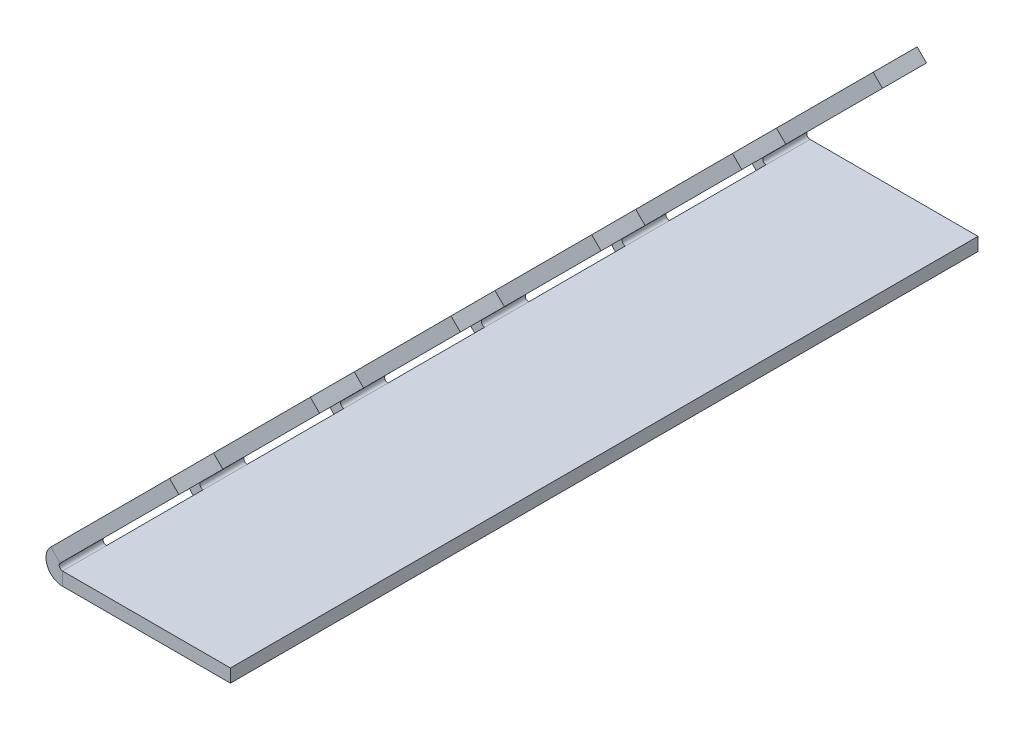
ISO-10303-21;
HEADER;
FILE_DESCRIPTION(('STEP AP214'),'2;1');
FILE_NAME('part.step','',(''),(''),'','','');
FILE_SCHEMA(('AUTOMOTIVE_DESIGN { 1 0 10303 214 1 1 1 1 }'));
ENDSEC;
DATA;
#1=APPLICATION_CONTEXT('core data for automotive mechanical design processes');
#2=APPLICATION_PROTOCOL_DEFINITION('international standard','automotive_design',2000,#1);
#3=PRODUCT_CONTEXT('',#1,'mechanical');
#4=PRODUCT('Part','Part','',(#3));
#5=PRODUCT_RELATED_PRODUCT_CATEGORY('part','',(#4));
#6=PRODUCT_DEFINITION_FORMATION('','',#4);
#7=PRODUCT_DEFINITION_CONTEXT('part definition',#1,'design');
#8=PRODUCT_DEFINITION('design','',#6,#7);
#9=PRODUCT_DEFINITION_SHAPE('','',#8);
#10=(LENGTH_UNIT() NAMED_UNIT(*) SI_UNIT(.MILLI.,.METRE.));
#11=(NAMED_UNIT(*) PLANE_ANGLE_UNIT() SI_UNIT($,.RADIAN.));
#12=(NAMED_UNIT(*) SI_UNIT($,.STERADIAN.) SOLID_ANGLE_UNIT());
#13=UNCERTAINTY_MEASURE_WITH_UNIT(LENGTH_MEASURE(1.E-05),#10,'distance_accuracy_value','');
#14=(GEOMETRIC_REPRESENTATION_CONTEXT(3) GLOBAL_UNCERTAINTY_ASSIGNED_CONTEXT((#13)) GLOBAL_UNIT_ASSIGNED_CONTEXT((#10,
#11,#12)) REPRESENTATION_CONTEXT('',''));
#15=CARTESIAN_POINT('',(0.,0.,0.));
#16=DIRECTION('',(0.,0.,1.));
#17=DIRECTION('',(1.,0.,0.));
#18=AXIS2_PLACEMENT_3D('',#15,#16,#17);
#19=CARTESIAN_POINT('',(0.,0.,170.));
#20=DIRECTION('',(-0.707106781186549,0.707106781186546,0.));
#21=DIRECTION('',(-0.707106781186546,-0.707106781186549,0.));
#22=AXIS2_PLACEMENT_3D('',#19,#20,#21);
#23=PLANE('',#22);
#24=DIRECTION('',(-0.707106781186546,-0.707106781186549,0.));
#25=VECTOR('',#24,1.);
#26=CARTESIAN_POINT('',(0.,0.,138.));
#27=LINE('',#26,#25);
#28=CARTESIAN_POINT('',(28.2842712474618,28.284271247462,138.));
#29=VERTEX_POINT('',#28);
#30=CARTESIAN_POINT('',(1.2803300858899,1.28033008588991,138.));
#31=VERTEX_POINT('',#30);
#32=EDGE_CURVE('E900',#29,#31,#27,.T.);
#33=ORIENTED_EDGE('',*,*,#32,.T.);
#34=DIRECTION('',(0.,0.,-1.));
#35=VECTOR('',#34,1.);
#36=CARTESIAN_POINT('',(1.2803300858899,1.28033008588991,170.));
#37=LINE('',#36,#35);
#38=CARTESIAN_POINT('',(1.2803300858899,1.28033008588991,128.));
#39=VERTEX_POINT('',#38);
#40=EDGE_CURVE('E627',#31,#39,#37,.T.);
#41=ORIENTED_EDGE('',*,*,#40,.T.);
#42=DIRECTION('',(0.707106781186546,0.707106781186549,0.));
#43=VECTOR('',#42,1.);
#44=CARTESIAN_POINT('',(0.,0.,128.));
#45=LINE('',#44,#43);
#46=CARTESIAN_POINT('',(28.2842712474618,28.284271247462,128.));
#47=VERTEX_POINT('',#46);
#48=EDGE_CURVE('E746',#39,#47,#45,.T.);
#49=ORIENTED_EDGE('',*,*,#48,.T.);
#50=DIRECTION('',(0.,0.,-1.));
#51=VECTOR('',#50,1.);
#52=CARTESIAN_POINT('',(28.2842712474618,28.284271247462,170.));
#53=LINE('',#52,#51);
#54=EDGE_CURVE('E1063',#29,#47,#53,.T.);
#55=ORIENTED_EDGE('',*,*,#54,.F.);
#56=EDGE_LOOP('',(#33,#41,#49,#55));
#57=FACE_BOUND('',#56,.T.);
#58=ADVANCED_FACE('F356',(#57),#23,.F.);
#59=DIRECTION('',(0.707106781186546,0.707106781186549,0.));
#60=VECTOR('',#59,1.);
#61=CARTESIAN_POINT('',(0.,0.,160.));
#62=LINE('',#61,#60);
#63=CARTESIAN_POINT('',(1.2803300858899,1.28033008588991,160.));
#64=VERTEX_POINT('',#63);
#65=CARTESIAN_POINT('',(28.2842712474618,28.284271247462,160.));
#66=VERTEX_POINT('',#65);
#67=EDGE_CURVE('E619',#64,#66,#62,.T.);
#68=ORIENTED_EDGE('',*,*,#67,.T.);
#69=CARTESIAN_POINT('',(28.2842712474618,28.284271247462,170.));
#70=VERTEX_POINT('',#69);
#71=EDGE_CURVE('E1064',#70,#66,#53,.T.);
#72=ORIENTED_EDGE('',*,*,#71,.F.);
#73=DIRECTION('',(0.707106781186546,0.707106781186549,0.));
#74=VECTOR('',#73,1.);
#75=CARTESIAN_POINT('',(0.,0.,170.));
#76=LINE('',#75,#74);
#77=CARTESIAN_POINT('',(1.2803300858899,1.28033008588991,170.));
#78=VERTEX_POINT('',#77);
#79=EDGE_CURVE('E705',#78,#70,#76,.T.);
#80=ORIENTED_EDGE('',*,*,#79,.F.);
#81=EDGE_CURVE('E645',#78,#64,#37,.T.);
#82=ORIENTED_EDGE('',*,*,#81,.T.);
#83=EDGE_LOOP('',(#68,#72,#80,#82));
#84=FACE_BOUND('',#83,.T.);
#85=ADVANCED_FACE('F1007',(#84),#23,.F.);
#86=CARTESIAN_POINT('',(26.1629509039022,30.4055915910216,170.));
#87=DIRECTION('',(0.707106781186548,0.707106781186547,0.));
#88=DIRECTION('',(-0.707106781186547,0.707106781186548,0.));
#89=AXIS2_PLACEMENT_3D('',#86,#87,#88);
#90=PLANE('',#89);
#91=DIRECTION('',(0.,0.,-1.));
#92=VECTOR('',#91,1.);
#93=CARTESIAN_POINT('',(26.1629509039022,30.4055915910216,170.));
#94=LINE('',#93,#92);
#95=CARTESIAN_POINT('',(26.1629509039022,30.4055915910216,138.));
#96=VERTEX_POINT('',#95);
#97=CARTESIAN_POINT('',(26.1629509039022,30.4055915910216,128.));
#98=VERTEX_POINT('',#97);
#99=EDGE_CURVE('E937',#96,#98,#94,.T.);
#100=ORIENTED_EDGE('',*,*,#99,.F.);
#101=DIRECTION('',(0.707106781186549,-0.707106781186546,0.));
#102=VECTOR('',#101,1.);
#103=CARTESIAN_POINT('',(28.2842712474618,28.284271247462,138.));
#104=LINE('',#103,#102);
#105=EDGE_CURVE('E893',#29,#96,#104,.F.);
#106=ORIENTED_EDGE('',*,*,#105,.F.);
#107=ORIENTED_EDGE('',*,*,#54,.T.);
#108=DIRECTION('',(0.707106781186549,-0.707106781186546,0.));
#109=VECTOR('',#108,1.);
#110=CARTESIAN_POINT('',(28.2842712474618,28.284271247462,128.));
#111=LINE('',#110,#109);
#112=EDGE_CURVE('E732',#47,#98,#111,.F.);
#113=ORIENTED_EDGE('',*,*,#112,.T.);
#114=EDGE_LOOP('',(#100,#106,#107,#113));
#115=FACE_BOUND('',#114,.T.);
#116=ADVANCED_FACE('F1014',(#115),#90,.T.);
#117=ORIENTED_EDGE('',*,*,#71,.T.);
#118=DIRECTION('',(0.707106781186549,-0.707106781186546,0.));
#119=VECTOR('',#118,1.);
#120=CARTESIAN_POINT('',(28.2842712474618,28.284271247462,160.));
#121=LINE('',#120,#119);
#122=CARTESIAN_POINT('',(26.1629509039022,30.4055915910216,160.));
#123=VERTEX_POINT('',#122);
#124=EDGE_CURVE('E890',#66,#123,#121,.F.);
#125=ORIENTED_EDGE('',*,*,#124,.T.);
#126=CARTESIAN_POINT('',(26.1629509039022,30.4055915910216,170.));
#127=VERTEX_POINT('',#126);
#128=EDGE_CURVE('E925',#127,#123,#94,.T.);
#129=ORIENTED_EDGE('',*,*,#128,.F.);
#130=DIRECTION('',(0.707106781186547,-0.707106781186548,0.));
#131=VECTOR('',#130,1.);
#132=CARTESIAN_POINT('',(26.1629509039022,30.4055915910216,170.));
#133=LINE('',#132,#131);
#134=EDGE_CURVE('E702',#127,#70,#133,.T.);
#135=ORIENTED_EDGE('',*,*,#134,.T.);
#136=EDGE_LOOP('',(#117,#125,#129,#135));
#137=FACE_BOUND('',#136,.T.);
#138=ADVANCED_FACE('F1155',(#137),#90,.T.);
#139=CARTESIAN_POINT('',(-2.12132034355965,2.12132034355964,170.));
#140=DIRECTION('',(-0.707106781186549,0.707106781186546,0.));
#141=DIRECTION('',(-0.707106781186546,-0.707106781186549,0.));
#142=AXIS2_PLACEMENT_3D('',#139,#140,#141);
#143=PLANE('',#142);
#144=DIRECTION('',(0.,0.,-1.));
#145=VECTOR('',#144,1.);
#146=CARTESIAN_POINT('',(-0.840990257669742,3.40165042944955,170.));
#147=LINE('',#146,#145);
#148=CARTESIAN_POINT('',(-0.840990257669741,3.40165042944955,138.));
#149=VERTEX_POINT('',#148);
#150=CARTESIAN_POINT('',(-0.840990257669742,3.40165042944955,128.));
#151=VERTEX_POINT('',#150);
#152=EDGE_CURVE('E932',#149,#151,#147,.T.);
#153=ORIENTED_EDGE('',*,*,#152,.F.);
#154=DIRECTION('',(-0.707106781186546,-0.707106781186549,0.));
#155=VECTOR('',#154,1.);
#156=CARTESIAN_POINT('',(-2.12132034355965,2.12132034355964,138.));
#157=LINE('',#156,#155);
#158=EDGE_CURVE('E891',#96,#149,#157,.T.);
#159=ORIENTED_EDGE('',*,*,#158,.F.);
#160=ORIENTED_EDGE('',*,*,#99,.T.);
#161=DIRECTION('',(-0.707106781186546,-0.707106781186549,0.));
#162=VECTOR('',#161,1.);
#163=CARTESIAN_POINT('',(-2.12132034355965,2.12132034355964,128.));
#164=LINE('',#163,#162);
#165=EDGE_CURVE('E741',#151,#98,#164,.F.);
#166=ORIENTED_EDGE('',*,*,#165,.F.);
#167=EDGE_LOOP('',(#153,#159,#160,#166));
#168=FACE_BOUND('',#167,.T.);
#169=ADVANCED_FACE('F1114',(#168),#143,.T.);
#170=ORIENTED_EDGE('',*,*,#128,.T.);
#171=DIRECTION('',(-0.707106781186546,-0.707106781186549,0.));
#172=VECTOR('',#171,1.);
#173=CARTESIAN_POINT('',(-2.12132034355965,2.12132034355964,160.));
#174=LINE('',#173,#172);
#175=CARTESIAN_POINT('',(-0.840990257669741,3.40165042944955,160.));
#176=VERTEX_POINT('',#175);
#177=EDGE_CURVE('E898',#176,#123,#174,.F.);
#178=ORIENTED_EDGE('',*,*,#177,.F.);
#179=CARTESIAN_POINT('',(-0.840990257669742,3.40165042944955,170.));
#180=VERTEX_POINT('',#179);
#181=EDGE_CURVE('E923',#180,#176,#147,.T.);
#182=ORIENTED_EDGE('',*,*,#181,.F.);
#183=DIRECTION('',(0.707106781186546,0.707106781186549,0.));
#184=VECTOR('',#183,1.);
#185=CARTESIAN_POINT('',(-2.12132034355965,2.12132034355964,170.));
#186=LINE('',#185,#184);
#187=EDGE_CURVE('E699',#180,#127,#186,.T.);
#188=ORIENTED_EDGE('',*,*,#187,.T.);
#189=EDGE_LOOP('',(#170,#178,#182,#188));
#190=FACE_BOUND('',#189,.T.);
#191=ADVANCED_FACE('F922',(#190),#143,.T.);
#192=CARTESIAN_POINT('',(1.81066017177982,0.75,170.));
#193=DIRECTION('',(0.,0.,-1.));
#194=DIRECTION('',(-1.,0.,0.));
#195=AXIS2_PLACEMENT_3D('',#192,#193,#194);
#196=CYLINDRICAL_SURFACE('',#195,3.75);
#197=DIRECTION('',(0.,0.,-1.));
#198=VECTOR('',#197,1.);
#199=CARTESIAN_POINT('',(1.81066017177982,-3.,170.));
#200=LINE('',#199,#198);
#201=CARTESIAN_POINT('',(1.81066017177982,-3.,138.));
#202=VERTEX_POINT('',#201);
#203=CARTESIAN_POINT('',(1.81066017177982,-3.,128.));
#204=VERTEX_POINT('',#203);
#205=EDGE_CURVE('E963',#202,#204,#200,.T.);
#206=ORIENTED_EDGE('',*,*,#205,.F.);
#207=CARTESIAN_POINT('',(1.81066017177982,0.75,138.));
#208=DIRECTION('',(0.,0.,-1.));
#209=DIRECTION('',(-1.,0.,0.));
#210=AXIS2_PLACEMENT_3D('',#207,#208,#209);
#211=CIRCLE('',#210,3.75);
#212=EDGE_CURVE('E618',#149,#202,#211,.F.);
#213=ORIENTED_EDGE('',*,*,#212,.F.);
#214=ORIENTED_EDGE('',*,*,#152,.T.);
#215=CARTESIAN_POINT('',(1.81066017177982,0.75,128.));
#216=DIRECTION('',(0.,0.,1.));
#217=DIRECTION('',(1.,0.,0.));
#218=AXIS2_PLACEMENT_3D('',#215,#216,#217);
#219=CIRCLE('',#218,3.75);
#220=EDGE_CURVE('E756',#204,#151,#219,.F.);
#221=ORIENTED_EDGE('',*,*,#220,.F.);
#222=EDGE_LOOP('',(#206,#213,#214,#221));
#223=FACE_BOUND('',#222,.T.);
#224=ADVANCED_FACE('F1111',(#223),#196,.T.);
#225=ORIENTED_EDGE('',*,*,#181,.T.);
#226=CARTESIAN_POINT('',(1.81066017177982,0.75,160.));
#227=DIRECTION('',(0.,0.,-1.));
#228=DIRECTION('',(-1.,0.,0.));
#229=AXIS2_PLACEMENT_3D('',#226,#227,#228);
#230=CIRCLE('',#229,3.75);
#231=CARTESIAN_POINT('',(1.81066017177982,-3.,160.));
#232=VERTEX_POINT('',#231);
#233=EDGE_CURVE('E628',#232,#176,#230,.T.);
#234=ORIENTED_EDGE('',*,*,#233,.F.);
#235=CARTESIAN_POINT('',(1.81066017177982,-3.,170.));
#236=VERTEX_POINT('',#235);
#237=EDGE_CURVE('E957',#236,#232,#200,.T.);
#238=ORIENTED_EDGE('',*,*,#237,.F.);
#239=CARTESIAN_POINT('',(1.81066017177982,0.75,170.));
#240=DIRECTION('',(0.,0.,1.));
#241=DIRECTION('',(1.,0.,0.));
#242=AXIS2_PLACEMENT_3D('',#239,#240,#241);
#243=CIRCLE('',#242,3.75);
#244=EDGE_CURVE('E696',#236,#180,#243,.F.);
#245=ORIENTED_EDGE('',*,*,#244,.T.);
#246=EDGE_LOOP('',(#225,#234,#238,#245));
#247=FACE_BOUND('',#246,.T.);
#248=ADVANCED_FACE('F927',(#247),#196,.T.);
#249=CARTESIAN_POINT('',(1.81066017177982,0.75,170.));
#250=DIRECTION('',(0.,0.,-1.));
#251=DIRECTION('',(-1.,0.,0.));
#252=AXIS2_PLACEMENT_3D('',#249,#250,#251);
#253=CYLINDRICAL_SURFACE('',#252,0.75);
#254=CARTESIAN_POINT('',(1.81066017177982,0.75,138.));
#255=DIRECTION('',(0.,0.,-1.));
#256=DIRECTION('',(-1.,0.,0.));
#257=AXIS2_PLACEMENT_3D('',#254,#255,#256);
#258=CIRCLE('',#257,0.75);
#259=CARTESIAN_POINT('',(1.81066017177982,0.,138.));
#260=VERTEX_POINT('',#259);
#261=EDGE_CURVE('E608',#31,#260,#258,.F.);
#262=ORIENTED_EDGE('',*,*,#261,.T.);
#263=DIRECTION('',(0.,0.,-1.));
#264=VECTOR('',#263,1.);
#265=CARTESIAN_POINT('',(1.81066017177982,0.,170.));
#266=LINE('',#265,#264);
#267=CARTESIAN_POINT('',(1.81066017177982,0.,128.));
#268=VERTEX_POINT('',#267);
#269=EDGE_CURVE('E625',#260,#268,#266,.T.);
#270=ORIENTED_EDGE('',*,*,#269,.T.);
#271=CARTESIAN_POINT('',(1.81066017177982,0.75,128.));
#272=DIRECTION('',(0.,0.,-1.));
#273=DIRECTION('',(-1.,0.,0.));
#274=AXIS2_PLACEMENT_3D('',#271,#272,#273);
#275=CIRCLE('',#274,0.75);
#276=EDGE_CURVE('E750',#268,#39,#275,.T.);
#277=ORIENTED_EDGE('',*,*,#276,.T.);
#278=ORIENTED_EDGE('',*,*,#40,.F.);
#279=EDGE_LOOP('',(#262,#270,#277,#278));
#280=FACE_BOUND('',#279,.T.);
#281=ADVANCED_FACE('F623',(#280),#253,.F.);
#282=CARTESIAN_POINT('',(1.81066017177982,0.75,160.));
#283=DIRECTION('',(0.,0.,1.));
#284=DIRECTION('',(1.,0.,0.));
#285=AXIS2_PLACEMENT_3D('',#282,#283,#284);
#286=CIRCLE('',#285,0.75);
#287=CARTESIAN_POINT('',(1.81066017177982,0.,160.));
#288=VERTEX_POINT('',#287);
#289=EDGE_CURVE('E609',#288,#64,#286,.F.);
#290=ORIENTED_EDGE('',*,*,#289,.T.);
#291=ORIENTED_EDGE('',*,*,#81,.F.);
#292=CARTESIAN_POINT('',(1.81066017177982,0.75,170.));
#293=DIRECTION('',(0.,0.,1.));
#294=DIRECTION('',(1.,0.,0.));
#295=AXIS2_PLACEMENT_3D('',#292,#293,#294);
#296=CIRCLE('',#295,0.75);
#297=CARTESIAN_POINT('',(1.81066017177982,0.,170.));
#298=VERTEX_POINT('',#297);
#299=EDGE_CURVE('E677',#298,#78,#296,.F.);
#300=ORIENTED_EDGE('',*,*,#299,.F.);
#301=EDGE_CURVE('E635',#298,#288,#266,.T.);
#302=ORIENTED_EDGE('',*,*,#301,.T.);
#303=EDGE_LOOP('',(#290,#291,#300,#302));
#304=FACE_BOUND('',#303,.T.);
#305=ADVANCED_FACE('F910',(#304),#253,.F.);
#306=DIRECTION('',(-0.707106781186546,-0.707106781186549,0.));
#307=VECTOR('',#306,1.);
#308=CARTESIAN_POINT('',(0.,0.,10.));
#309=LINE('',#308,#307);
#310=CARTESIAN_POINT('',(28.2842712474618,28.284271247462,10.));
#311=VERTEX_POINT('',#310);
#312=CARTESIAN_POINT('',(1.2803300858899,1.28033008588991,10.));
#313=VERTEX_POINT('',#312);
#314=EDGE_CURVE('E864',#311,#313,#309,.T.);
#315=ORIENTED_EDGE('',*,*,#314,.T.);
#316=CARTESIAN_POINT('',(1.2803300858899,1.28033008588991,0.));
#317=VERTEX_POINT('',#316);
#318=EDGE_CURVE('E658',#313,#317,#37,.T.);
#319=ORIENTED_EDGE('',*,*,#318,.T.);
#320=DIRECTION('',(0.707106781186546,0.707106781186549,0.));
#321=VECTOR('',#320,1.);
#322=CARTESIAN_POINT('',(0.,0.,0.));
#323=LINE('',#322,#321);
#324=CARTESIAN_POINT('',(28.2842712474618,28.284271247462,0.));
#325=VERTEX_POINT('',#324);
#326=EDGE_CURVE('E726',#317,#325,#323,.T.);
#327=ORIENTED_EDGE('',*,*,#326,.T.);
#328=EDGE_CURVE('E1066',#311,#325,#53,.T.);
#329=ORIENTED_EDGE('',*,*,#328,.F.);
#330=EDGE_LOOP('',(#315,#319,#327,#329));
#331=FACE_BOUND('',#330,.T.);
#332=ADVANCED_FACE('F1010',(#331),#23,.F.);
#333=DIRECTION('',(0.707106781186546,0.707106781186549,0.));
#334=VECTOR('',#333,1.);
#335=CARTESIAN_POINT('',(0.,0.,32.));
#336=LINE('',#335,#334);
#337=CARTESIAN_POINT('',(1.2803300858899,1.28033008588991,32.));
#338=VERTEX_POINT('',#337);
#339=CARTESIAN_POINT('',(28.2842712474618,28.284271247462,32.));
#340=VERTEX_POINT('',#339);
#341=EDGE_CURVE('E866',#338,#340,#336,.T.);
#342=ORIENTED_EDGE('',*,*,#341,.T.);
#343=CARTESIAN_POINT('',(28.2842712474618,28.284271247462,42.));
#344=VERTEX_POINT('',#343);
#345=EDGE_CURVE('E1060',#344,#340,#53,.T.);
#346=ORIENTED_EDGE('',*,*,#345,.F.);
#347=DIRECTION('',(-0.707106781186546,-0.707106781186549,0.));
#348=VECTOR('',#347,1.);
#349=CARTESIAN_POINT('',(0.,0.,42.));
#350=LINE('',#349,#348);
#351=CARTESIAN_POINT('',(1.2803300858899,1.28033008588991,42.));
#352=VERTEX_POINT('',#351);
#353=EDGE_CURVE('E824',#344,#352,#350,.T.);
#354=ORIENTED_EDGE('',*,*,#353,.T.);
#355=EDGE_CURVE('E667',#352,#338,#37,.T.);
#356=ORIENTED_EDGE('',*,*,#355,.T.);
#357=EDGE_LOOP('',(#342,#346,#354,#356));
#358=FACE_BOUND('',#357,.T.);
#359=ADVANCED_FACE('F1015',(#358),#23,.F.);
#360=CARTESIAN_POINT('',(26.1629509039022,30.4055915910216,10.));
#361=VERTEX_POINT('',#360);
#362=CARTESIAN_POINT('',(26.1629509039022,30.4055915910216,0.));
#363=VERTEX_POINT('',#362);
#364=EDGE_CURVE('E931',#361,#363,#94,.T.);
#365=ORIENTED_EDGE('',*,*,#364,.F.);
#366=DIRECTION('',(0.707106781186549,-0.707106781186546,0.));
#367=VECTOR('',#366,1.);
#368=CARTESIAN_POINT('',(28.2842712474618,28.284271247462,10.));
#369=LINE('',#368,#367);
#370=EDGE_CURVE('E857',#311,#361,#369,.F.);
#371=ORIENTED_EDGE('',*,*,#370,.F.);
#372=ORIENTED_EDGE('',*,*,#328,.T.);
#373=DIRECTION('',(0.707106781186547,-0.707106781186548,0.));
#374=VECTOR('',#373,1.);
#375=CARTESIAN_POINT('',(26.1629509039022,30.4055915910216,0.));
#376=LINE('',#375,#374);
#377=EDGE_CURVE('E723',#363,#325,#376,.T.);
#378=ORIENTED_EDGE('',*,*,#377,.F.);
#379=EDGE_LOOP('',(#365,#371,#372,#378));
#380=FACE_BOUND('',#379,.T.);
#381=ADVANCED_FACE('F1024',(#380),#90,.T.);
#382=ORIENTED_EDGE('',*,*,#345,.T.);
#383=DIRECTION('',(0.707106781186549,-0.707106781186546,0.));
#384=VECTOR('',#383,1.);
#385=CARTESIAN_POINT('',(28.2842712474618,28.284271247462,32.));
#386=LINE('',#385,#384);
#387=CARTESIAN_POINT('',(26.1629509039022,30.4055915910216,32.));
#388=VERTEX_POINT('',#387);
#389=EDGE_CURVE('E853',#340,#388,#386,.F.);
#390=ORIENTED_EDGE('',*,*,#389,.T.);
#391=CARTESIAN_POINT('',(26.1629509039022,30.4055915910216,42.));
#392=VERTEX_POINT('',#391);
#393=EDGE_CURVE('E935',#392,#388,#94,.T.);
#394=ORIENTED_EDGE('',*,*,#393,.F.);
#395=DIRECTION('',(0.707106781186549,-0.707106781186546,0.));
#396=VECTOR('',#395,1.);
#397=CARTESIAN_POINT('',(28.2842712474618,28.284271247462,42.));
#398=LINE('',#397,#396);
#399=EDGE_CURVE('E817',#344,#392,#398,.F.);
#400=ORIENTED_EDGE('',*,*,#399,.F.);
#401=EDGE_LOOP('',(#382,#390,#394,#400));
#402=FACE_BOUND('',#401,.T.);
#403=ADVANCED_FACE('F1048',(#402),#90,.T.);
#404=CARTESIAN_POINT('',(-0.840990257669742,3.40165042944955,10.));
#405=VERTEX_POINT('',#404);
#406=CARTESIAN_POINT('',(-0.840990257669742,3.40165042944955,0.));
#407=VERTEX_POINT('',#406);
#408=EDGE_CURVE('E938',#405,#407,#147,.T.);
#409=ORIENTED_EDGE('',*,*,#408,.F.);
#410=DIRECTION('',(-0.707106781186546,-0.707106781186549,0.));
#411=VECTOR('',#410,1.);
#412=CARTESIAN_POINT('',(-2.12132034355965,2.12132034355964,10.));
#413=LINE('',#412,#411);
#414=EDGE_CURVE('E854',#361,#405,#413,.T.);
#415=ORIENTED_EDGE('',*,*,#414,.F.);
#416=ORIENTED_EDGE('',*,*,#364,.T.);
#417=DIRECTION('',(0.707106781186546,0.707106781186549,0.));
#418=VECTOR('',#417,1.);
#419=CARTESIAN_POINT('',(-2.12132034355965,2.12132034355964,0.));
#420=LINE('',#419,#418);
#421=EDGE_CURVE('E720',#407,#363,#420,.T.);
#422=ORIENTED_EDGE('',*,*,#421,.F.);
#423=EDGE_LOOP('',(#409,#415,#416,#422));
#424=FACE_BOUND('',#423,.T.);
#425=ADVANCED_FACE('F1149',(#424),#143,.T.);
#426=ORIENTED_EDGE('',*,*,#393,.T.);
#427=DIRECTION('',(-0.707106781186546,-0.707106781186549,0.));
#428=VECTOR('',#427,1.);
#429=CARTESIAN_POINT('',(-2.12132034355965,2.12132034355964,32.));
#430=LINE('',#429,#428);
#431=CARTESIAN_POINT('',(-0.840990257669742,3.40165042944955,32.));
#432=VERTEX_POINT('',#431);
#433=EDGE_CURVE('E862',#432,#388,#430,.F.);
#434=ORIENTED_EDGE('',*,*,#433,.F.);
#435=CARTESIAN_POINT('',(-0.840990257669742,3.40165042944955,42.));
#436=VERTEX_POINT('',#435);
#437=EDGE_CURVE('E947',#436,#432,#147,.T.);
#438=ORIENTED_EDGE('',*,*,#437,.F.);
#439=DIRECTION('',(-0.707106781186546,-0.707106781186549,0.));
#440=VECTOR('',#439,1.);
#441=CARTESIAN_POINT('',(-2.12132034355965,2.12132034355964,42.));
#442=LINE('',#441,#440);
#443=EDGE_CURVE('E814',#392,#436,#442,.T.);
#444=ORIENTED_EDGE('',*,*,#443,.F.);
#445=EDGE_LOOP('',(#426,#434,#438,#444));
#446=FACE_BOUND('',#445,.T.);
#447=ADVANCED_FACE('F1129',(#446),#143,.T.);
#448=CARTESIAN_POINT('',(1.81066017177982,-3.,10.));
#449=VERTEX_POINT('',#448);
#450=CARTESIAN_POINT('',(1.81066017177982,-3.,0.));
#451=VERTEX_POINT('',#450);
#452=EDGE_CURVE('E967',#449,#451,#200,.T.);
#453=ORIENTED_EDGE('',*,*,#452,.F.);
#454=CARTESIAN_POINT('',(1.81066017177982,0.75,10.));
#455=DIRECTION('',(0.,0.,-1.));
#456=DIRECTION('',(-1.,0.,0.));
#457=AXIS2_PLACEMENT_3D('',#454,#455,#456);
#458=CIRCLE('',#457,3.75);
#459=EDGE_CURVE('E872',#405,#449,#458,.F.);
#460=ORIENTED_EDGE('',*,*,#459,.F.);
#461=ORIENTED_EDGE('',*,*,#408,.T.);
#462=CARTESIAN_POINT('',(1.81066017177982,0.75,0.));
#463=DIRECTION('',(0.,0.,1.));
#464=DIRECTION('',(1.,0.,0.));
#465=AXIS2_PLACEMENT_3D('',#462,#463,#464);
#466=CIRCLE('',#465,3.75);
#467=EDGE_CURVE('E717',#451,#407,#466,.F.);
#468=ORIENTED_EDGE('',*,*,#467,.F.);
#469=EDGE_LOOP('',(#453,#460,#461,#468));
#470=FACE_BOUND('',#469,.T.);
#471=ADVANCED_FACE('F1146',(#470),#196,.T.);
#472=ORIENTED_EDGE('',*,*,#437,.T.);
#473=CARTESIAN_POINT('',(1.81066017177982,0.75,32.));
#474=DIRECTION('',(0.,0.,1.));
#475=DIRECTION('',(1.,0.,0.));
#476=AXIS2_PLACEMENT_3D('',#473,#474,#475);
#477=CIRCLE('',#476,3.75);
#478=CARTESIAN_POINT('',(1.81066017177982,-3.,32.));
#479=VERTEX_POINT('',#478);
#480=EDGE_CURVE('E875',#479,#432,#477,.F.);
#481=ORIENTED_EDGE('',*,*,#480,.F.);
#482=CARTESIAN_POINT('',(1.81066017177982,-3.,42.));
#483=VERTEX_POINT('',#482);
#484=EDGE_CURVE('E975',#483,#479,#200,.T.);
#485=ORIENTED_EDGE('',*,*,#484,.F.);
#486=CARTESIAN_POINT('',(1.81066017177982,0.75,42.));
#487=DIRECTION('',(0.,0.,-1.));
#488=DIRECTION('',(-1.,0.,0.));
#489=AXIS2_PLACEMENT_3D('',#486,#487,#488);
#490=CIRCLE('',#489,3.75);
#491=EDGE_CURVE('E832',#436,#483,#490,.F.);
#492=ORIENTED_EDGE('',*,*,#491,.F.);
#493=EDGE_LOOP('',(#472,#481,#485,#492));
#494=FACE_BOUND('',#493,.T.);
#495=ADVANCED_FACE('F1182',(#494),#196,.T.);
#496=CARTESIAN_POINT('',(1.81066017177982,0.75,10.));
#497=DIRECTION('',(0.,0.,-1.));
#498=DIRECTION('',(-1.,0.,0.));
#499=AXIS2_PLACEMENT_3D('',#496,#497,#498);
#500=CIRCLE('',#499,0.75);
#501=CARTESIAN_POINT('',(1.81066017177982,0.,10.));
#502=VERTEX_POINT('',#501);
#503=EDGE_CURVE('E868',#313,#502,#500,.F.);
#504=ORIENTED_EDGE('',*,*,#503,.T.);
#505=CARTESIAN_POINT('',(1.81066017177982,0.,0.));
#506=VERTEX_POINT('',#505);
#507=EDGE_CURVE('E638',#502,#506,#266,.T.);
#508=ORIENTED_EDGE('',*,*,#507,.T.);
#509=CARTESIAN_POINT('',(1.81066017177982,0.75,0.));
#510=DIRECTION('',(0.,0.,1.));
#511=DIRECTION('',(1.,0.,0.));
#512=AXIS2_PLACEMENT_3D('',#509,#510,#511);
#513=CIRCLE('',#512,0.75);
#514=EDGE_CURVE('E707',#506,#317,#513,.F.);
#515=ORIENTED_EDGE('',*,*,#514,.T.);
#516=ORIENTED_EDGE('',*,*,#318,.F.);
#517=EDGE_LOOP('',(#504,#508,#515,#516));
#518=FACE_BOUND('',#517,.T.);
#519=ADVANCED_FACE('F1049',(#518),#253,.F.);
#520=CARTESIAN_POINT('',(1.81066017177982,0.75,32.));
#521=DIRECTION('',(0.,0.,-1.));
#522=DIRECTION('',(-1.,0.,0.));
#523=AXIS2_PLACEMENT_3D('',#520,#521,#522);
#524=CIRCLE('',#523,0.75);
#525=CARTESIAN_POINT('',(1.81066017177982,0.,32.));
#526=VERTEX_POINT('',#525);
#527=EDGE_CURVE('E869',#526,#338,#524,.T.);
#528=ORIENTED_EDGE('',*,*,#527,.T.);
#529=ORIENTED_EDGE('',*,*,#355,.F.);
#530=CARTESIAN_POINT('',(1.81066017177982,0.75,42.));
#531=DIRECTION('',(0.,0.,-1.));
#532=DIRECTION('',(-1.,0.,0.));
#533=AXIS2_PLACEMENT_3D('',#530,#531,#532);
#534=CIRCLE('',#533,0.75);
#535=CARTESIAN_POINT('',(1.81066017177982,0.,42.));
#536=VERTEX_POINT('',#535);
#537=EDGE_CURVE('E828',#352,#536,#534,.F.);
#538=ORIENTED_EDGE('',*,*,#537,.T.);
#539=EDGE_CURVE('E644',#536,#526,#266,.T.);
#540=ORIENTED_EDGE('',*,*,#539,.T.);
#541=EDGE_LOOP('',(#528,#529,#538,#540));
#542=FACE_BOUND('',#541,.T.);
#543=ADVANCED_FACE('F1027',(#542),#253,.F.);
#544=DIRECTION('',(0.707106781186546,0.707106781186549,0.));
#545=VECTOR('',#544,1.);
#546=CARTESIAN_POINT('',(0.,0.,64.));
#547=LINE('',#546,#545);
#548=CARTESIAN_POINT('',(1.2803300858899,1.28033008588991,64.));
#549=VERTEX_POINT('',#548);
#550=CARTESIAN_POINT('',(28.2842712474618,28.284271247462,64.));
#551=VERTEX_POINT('',#550);
#552=EDGE_CURVE('E826',#549,#551,#547,.T.);
#553=ORIENTED_EDGE('',*,*,#552,.T.);
#554=CARTESIAN_POINT('',(28.2842712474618,28.284271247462,74.));
#555=VERTEX_POINT('',#554);
#556=EDGE_CURVE('E1053',#555,#551,#53,.T.);
#557=ORIENTED_EDGE('',*,*,#556,.F.);
#558=DIRECTION('',(-0.707106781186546,-0.707106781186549,0.));
#559=VECTOR('',#558,1.);
#560=CARTESIAN_POINT('',(0.,0.,74.));
#561=LINE('',#560,#559);
#562=CARTESIAN_POINT('',(1.2803300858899,1.28033008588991,74.));
#563=VERTEX_POINT('',#562);
#564=EDGE_CURVE('E784',#555,#563,#561,.T.);
#565=ORIENTED_EDGE('',*,*,#564,.T.);
#566=EDGE_CURVE('E661',#563,#549,#37,.T.);
#567=ORIENTED_EDGE('',*,*,#566,.T.);
#568=EDGE_LOOP('',(#553,#557,#565,#567));
#569=FACE_BOUND('',#568,.T.);
#570=ADVANCED_FACE('F1025',(#569),#23,.F.);
#571=ORIENTED_EDGE('',*,*,#556,.T.);
#572=DIRECTION('',(0.707106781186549,-0.707106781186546,0.));
#573=VECTOR('',#572,1.);
#574=CARTESIAN_POINT('',(28.2842712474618,28.284271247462,64.));
#575=LINE('',#574,#573);
#576=CARTESIAN_POINT('',(26.1629509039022,30.4055915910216,64.));
#577=VERTEX_POINT('',#576);
#578=EDGE_CURVE('E813',#551,#577,#575,.F.);
#579=ORIENTED_EDGE('',*,*,#578,.T.);
#580=CARTESIAN_POINT('',(26.1629509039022,30.4055915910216,74.));
#581=VERTEX_POINT('',#580);
#582=EDGE_CURVE('E1116',#581,#577,#94,.T.);
#583=ORIENTED_EDGE('',*,*,#582,.F.);
#584=DIRECTION('',(0.707106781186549,-0.707106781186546,0.));
#585=VECTOR('',#584,1.);
#586=CARTESIAN_POINT('',(28.2842712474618,28.284271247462,74.));
#587=LINE('',#586,#585);
#588=EDGE_CURVE('E777',#555,#581,#587,.F.);
#589=ORIENTED_EDGE('',*,*,#588,.F.);
#590=EDGE_LOOP('',(#571,#579,#583,#589));
#591=FACE_BOUND('',#590,.T.);
#592=ADVANCED_FACE('F1037',(#591),#90,.T.);
#593=ORIENTED_EDGE('',*,*,#582,.T.);
#594=DIRECTION('',(-0.707106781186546,-0.707106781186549,0.));
#595=VECTOR('',#594,1.);
#596=CARTESIAN_POINT('',(-2.12132034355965,2.12132034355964,64.));
#597=LINE('',#596,#595);
#598=CARTESIAN_POINT('',(-0.840990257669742,3.40165042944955,64.));
#599=VERTEX_POINT('',#598);
#600=EDGE_CURVE('E822',#599,#577,#597,.F.);
#601=ORIENTED_EDGE('',*,*,#600,.F.);
#602=CARTESIAN_POINT('',(-0.840990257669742,3.40165042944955,74.));
#603=VERTEX_POINT('',#602);
#604=EDGE_CURVE('E941',#603,#599,#147,.T.);
#605=ORIENTED_EDGE('',*,*,#604,.F.);
#606=DIRECTION('',(-0.707106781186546,-0.707106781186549,0.));
#607=VECTOR('',#606,1.);
#608=CARTESIAN_POINT('',(-2.12132034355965,2.12132034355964,74.));
#609=LINE('',#608,#607);
#610=EDGE_CURVE('E774',#581,#603,#609,.T.);
#611=ORIENTED_EDGE('',*,*,#610,.F.);
#612=EDGE_LOOP('',(#593,#601,#605,#611));
#613=FACE_BOUND('',#612,.T.);
#614=ADVANCED_FACE('F1046',(#613),#143,.T.);
#615=ORIENTED_EDGE('',*,*,#604,.T.);
#616=CARTESIAN_POINT('',(1.81066017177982,0.75,64.));
#617=DIRECTION('',(0.,0.,1.));
#618=DIRECTION('',(1.,0.,0.));
#619=AXIS2_PLACEMENT_3D('',#616,#617,#618);
#620=CIRCLE('',#619,3.75);
#621=CARTESIAN_POINT('',(1.81066017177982,-3.,64.));
#622=VERTEX_POINT('',#621);
#623=EDGE_CURVE('E836',#622,#599,#620,.F.);
#624=ORIENTED_EDGE('',*,*,#623,.F.);
#625=CARTESIAN_POINT('',(1.81066017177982,-3.,74.));
#626=VERTEX_POINT('',#625);
#627=EDGE_CURVE('E970',#626,#622,#200,.T.);
#628=ORIENTED_EDGE('',*,*,#627,.F.);
#629=CARTESIAN_POINT('',(1.81066017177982,0.75,74.));
#630=DIRECTION('',(0.,0.,-1.));
#631=DIRECTION('',(-1.,0.,0.));
#632=AXIS2_PLACEMENT_3D('',#629,#630,#631);
#633=CIRCLE('',#632,3.75);
#634=EDGE_CURVE('E792',#603,#626,#633,.F.);
#635=ORIENTED_EDGE('',*,*,#634,.F.);
#636=EDGE_LOOP('',(#615,#624,#628,#635));
#637=FACE_BOUND('',#636,.T.);
#638=ADVANCED_FACE('F1038',(#637),#196,.T.);
#639=CARTESIAN_POINT('',(1.81066017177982,0.75,64.));
#640=DIRECTION('',(0.,0.,-1.));
#641=DIRECTION('',(-1.,0.,0.));
#642=AXIS2_PLACEMENT_3D('',#639,#640,#641);
#643=CIRCLE('',#642,0.75);
#644=CARTESIAN_POINT('',(1.81066017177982,0.,64.));
#645=VERTEX_POINT('',#644);
#646=EDGE_CURVE('E829',#645,#549,#643,.T.);
#647=ORIENTED_EDGE('',*,*,#646,.T.);
#648=ORIENTED_EDGE('',*,*,#566,.F.);
#649=CARTESIAN_POINT('',(1.81066017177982,0.75,74.));
#650=DIRECTION('',(0.,0.,-1.));
#651=DIRECTION('',(-1.,0.,0.));
#652=AXIS2_PLACEMENT_3D('',#649,#650,#651);
#653=CIRCLE('',#652,0.75);
#654=CARTESIAN_POINT('',(1.81066017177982,0.,74.));
#655=VERTEX_POINT('',#654);
#656=EDGE_CURVE('E788',#563,#655,#653,.F.);
#657=ORIENTED_EDGE('',*,*,#656,.T.);
#658=EDGE_CURVE('E641',#655,#645,#266,.T.);
#659=ORIENTED_EDGE('',*,*,#658,.T.);
#660=EDGE_LOOP('',(#647,#648,#657,#659));
#661=FACE_BOUND('',#660,.T.);
#662=ADVANCED_FACE('F1030',(#661),#253,.F.);
#663=DIRECTION('',(0.707106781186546,0.707106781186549,0.));
#664=VECTOR('',#663,1.);
#665=CARTESIAN_POINT('',(0.,0.,96.));
#666=LINE('',#665,#664);
#667=CARTESIAN_POINT('',(1.2803300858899,1.28033008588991,96.));
#668=VERTEX_POINT('',#667);
#669=CARTESIAN_POINT('',(28.2842712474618,28.284271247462,96.));
#670=VERTEX_POINT('',#669);
#671=EDGE_CURVE('E786',#668,#670,#666,.T.);
#672=ORIENTED_EDGE('',*,*,#671,.T.);
#673=CARTESIAN_POINT('',(28.2842712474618,28.284271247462,106.));
#674=VERTEX_POINT('',#673);
#675=EDGE_CURVE('E1059',#674,#670,#53,.T.);
#676=ORIENTED_EDGE('',*,*,#675,.F.);
#677=DIRECTION('',(-0.707106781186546,-0.707106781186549,0.));
#678=VECTOR('',#677,1.);
#679=CARTESIAN_POINT('',(0.,0.,106.));
#680=LINE('',#679,#678);
#681=CARTESIAN_POINT('',(1.2803300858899,1.28033008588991,106.));
#682=VERTEX_POINT('',#681);
#683=EDGE_CURVE('E744',#674,#682,#680,.T.);
#684=ORIENTED_EDGE('',*,*,#683,.T.);
#685=EDGE_CURVE('E653',#682,#668,#37,.T.);
#686=ORIENTED_EDGE('',*,*,#685,.T.);
#687=EDGE_LOOP('',(#672,#676,#684,#686));
#688=FACE_BOUND('',#687,.T.);
#689=ADVANCED_FACE('F1019',(#688),#23,.F.);
#690=ORIENTED_EDGE('',*,*,#675,.T.);
#691=DIRECTION('',(0.707106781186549,-0.707106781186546,0.));
#692=VECTOR('',#691,1.);
#693=CARTESIAN_POINT('',(28.2842712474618,28.284271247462,96.));
#694=LINE('',#693,#692);
#695=CARTESIAN_POINT('',(26.1629509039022,30.4055915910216,96.));
#696=VERTEX_POINT('',#695);
#697=EDGE_CURVE('E773',#670,#696,#694,.F.);
#698=ORIENTED_EDGE('',*,*,#697,.T.);
#699=CARTESIAN_POINT('',(26.1629509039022,30.4055915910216,106.));
#700=VERTEX_POINT('',#699);
#701=EDGE_CURVE('E1095',#700,#696,#94,.T.);
#702=ORIENTED_EDGE('',*,*,#701,.F.);
#703=DIRECTION('',(0.707106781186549,-0.707106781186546,0.));
#704=VECTOR('',#703,1.);
#705=CARTESIAN_POINT('',(28.2842712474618,28.284271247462,106.));
#706=LINE('',#705,#704);
#707=EDGE_CURVE('E736',#674,#700,#706,.F.);
#708=ORIENTED_EDGE('',*,*,#707,.F.);
#709=EDGE_LOOP('',(#690,#698,#702,#708));
#710=FACE_BOUND('',#709,.T.);
#711=ADVANCED_FACE('F1029',(#710),#90,.T.);
#712=ORIENTED_EDGE('',*,*,#701,.T.);
#713=DIRECTION('',(-0.707106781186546,-0.707106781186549,0.));
#714=VECTOR('',#713,1.);
#715=CARTESIAN_POINT('',(-2.12132034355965,2.12132034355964,96.));
#716=LINE('',#715,#714);
#717=CARTESIAN_POINT('',(-0.840990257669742,3.40165042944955,96.));
#718=VERTEX_POINT('',#717);
#719=EDGE_CURVE('E782',#718,#696,#716,.F.);
#720=ORIENTED_EDGE('',*,*,#719,.F.);
#721=CARTESIAN_POINT('',(-0.840990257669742,3.40165042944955,106.));
#722=VERTEX_POINT('',#721);
#723=EDGE_CURVE('E934',#722,#718,#147,.T.);
#724=ORIENTED_EDGE('',*,*,#723,.F.);
#725=DIRECTION('',(-0.707106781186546,-0.707106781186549,0.));
#726=VECTOR('',#725,1.);
#727=CARTESIAN_POINT('',(-2.12132034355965,2.12132034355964,106.));
#728=LINE('',#727,#726);
#729=EDGE_CURVE('E733',#700,#722,#728,.T.);
#730=ORIENTED_EDGE('',*,*,#729,.F.);
#731=EDGE_LOOP('',(#712,#720,#724,#730));
#732=FACE_BOUND('',#731,.T.);
#733=ADVANCED_FACE('F1035',(#732),#143,.T.);
#734=ORIENTED_EDGE('',*,*,#723,.T.);
#735=CARTESIAN_POINT('',(1.81066017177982,0.75,96.));
#736=DIRECTION('',(0.,0.,1.));
#737=DIRECTION('',(1.,0.,0.));
#738=AXIS2_PLACEMENT_3D('',#735,#736,#737);
#739=CIRCLE('',#738,3.75);
#740=CARTESIAN_POINT('',(1.81066017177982,-3.,96.));
#741=VERTEX_POINT('',#740);
#742=EDGE_CURVE('E796',#741,#718,#739,.F.);
#743=ORIENTED_EDGE('',*,*,#742,.F.);
#744=CARTESIAN_POINT('',(1.81066017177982,-3.,106.));
#745=VERTEX_POINT('',#744);
#746=EDGE_CURVE('E964',#745,#741,#200,.T.);
#747=ORIENTED_EDGE('',*,*,#746,.F.);
#748=CARTESIAN_POINT('',(1.81066017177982,0.75,106.));
#749=DIRECTION('',(0.,0.,-1.));
#750=DIRECTION('',(-1.,0.,0.));
#751=AXIS2_PLACEMENT_3D('',#748,#749,#750);
#752=CIRCLE('',#751,3.75);
#753=EDGE_CURVE('E752',#722,#745,#752,.F.);
#754=ORIENTED_EDGE('',*,*,#753,.F.);
#755=EDGE_LOOP('',(#734,#743,#747,#754));
#756=FACE_BOUND('',#755,.T.);
#757=ADVANCED_FACE('F1174',(#756),#196,.T.);
#758=CARTESIAN_POINT('',(1.81066017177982,0.75,96.));
#759=DIRECTION('',(0.,0.,-1.));
#760=DIRECTION('',(-1.,0.,0.));
#761=AXIS2_PLACEMENT_3D('',#758,#759,#760);
#762=CIRCLE('',#761,0.75);
#763=CARTESIAN_POINT('',(1.81066017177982,0.,96.));
#764=VERTEX_POINT('',#763);
#765=EDGE_CURVE('E789',#764,#668,#762,.T.);
#766=ORIENTED_EDGE('',*,*,#765,.T.);
#767=ORIENTED_EDGE('',*,*,#685,.F.);
#768=CARTESIAN_POINT('',(1.81066017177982,0.75,106.));
#769=DIRECTION('',(0.,0.,-1.));
#770=DIRECTION('',(-1.,0.,0.));
#771=AXIS2_PLACEMENT_3D('',#768,#769,#770);
#772=CIRCLE('',#771,0.75);
#773=CARTESIAN_POINT('',(1.81066017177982,0.,106.));
#774=VERTEX_POINT('',#773);
#775=EDGE_CURVE('E749',#682,#774,#772,.F.);
#776=ORIENTED_EDGE('',*,*,#775,.T.);
#777=EDGE_CURVE('E636',#774,#764,#266,.T.);
#778=ORIENTED_EDGE('',*,*,#777,.T.);
#779=EDGE_LOOP('',(#766,#767,#776,#778));
#780=FACE_BOUND('',#779,.T.);
#781=ADVANCED_FACE('F1040',(#780),#253,.F.);
#782=CARTESIAN_POINT('',(1.81066017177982,0.,170.));
#783=DIRECTION('',(0.,0.,1.));
#784=DIRECTION('',(1.,0.,0.));
#785=AXIS2_PLACEMENT_3D('',#782,#783,#784);
#786=PLANE('',#785);
#787=DIRECTION('',(0.,-1.,0.));
#788=VECTOR('',#787,1.);
#789=CARTESIAN_POINT('',(1.81066017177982,0.,170.));
#790=LINE('',#789,#788);
#791=EDGE_CURVE('E11',#298,#236,#790,.T.);
#792=ORIENTED_EDGE('',*,*,#791,.F.);
#793=ORIENTED_EDGE('',*,*,#299,.T.);
#794=DIRECTION('',(0.707106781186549,-0.707106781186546,0.));
#795=VECTOR('',#794,1.);
#796=CARTESIAN_POINT('',(-0.840990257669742,3.40165042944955,170.));
#797=LINE('',#796,#795);
#798=EDGE_CURVE('E364',#180,#78,#797,.T.);
#799=ORIENTED_EDGE('',*,*,#798,.F.);
#800=ORIENTED_EDGE('',*,*,#244,.F.);
#801=EDGE_LOOP('',(#792,#793,#799,#800));
#802=FACE_BOUND('',#801,.T.);
#803=ADVANCED_FACE('F358',(#802),#786,.T.);
#804=CARTESIAN_POINT('',(-0.840990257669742,3.40165042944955,170.));
#805=DIRECTION('',(0.,0.,1.));
#806=DIRECTION('',(1.,0.,0.));
#807=AXIS2_PLACEMENT_3D('',#804,#805,#806);
#808=PLANE('',#807);
#809=DIRECTION('',(-1.,0.,0.));
#810=VECTOR('',#809,1.);
#811=CARTESIAN_POINT('',(0.,0.,170.));
#812=LINE('',#811,#810);
#813=CARTESIAN_POINT('',(40.,0.,170.));
#814=VERTEX_POINT('',#813);
#815=EDGE_CURVE('E684',#814,#298,#812,.T.);
#816=ORIENTED_EDGE('',*,*,#815,.T.);
#817=ORIENTED_EDGE('',*,*,#791,.T.);
#818=DIRECTION('',(1.,0.,0.));
#819=VECTOR('',#818,1.);
#820=CARTESIAN_POINT('',(0.,-3.,170.));
#821=LINE('',#820,#819);
#822=CARTESIAN_POINT('',(40.,-3.,170.));
#823=VERTEX_POINT('',#822);
#824=EDGE_CURVE('E693',#823,#236,#821,.F.);
#825=ORIENTED_EDGE('',*,*,#824,.F.);
#826=DIRECTION('',(0.,-1.,0.));
#827=VECTOR('',#826,1.);
#828=CARTESIAN_POINT('',(40.,0.,170.));
#829=LINE('',#828,#827);
#830=EDGE_CURVE('E688',#814,#823,#829,.T.);
#831=ORIENTED_EDGE('',*,*,#830,.F.);
#832=EDGE_LOOP('',(#816,#817,#825,#831));
#833=FACE_BOUND('',#832,.T.);
#834=ADVANCED_FACE('F1076',(#833),#808,.T.);
#835=CARTESIAN_POINT('',(1.2803300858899,1.28033008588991,0.));
#836=DIRECTION('',(0.,0.,-1.));
#837=DIRECTION('',(-1.,0.,0.));
#838=AXIS2_PLACEMENT_3D('',#835,#836,#837);
#839=PLANE('',#838);
#840=DIRECTION('',(-0.707106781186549,0.707106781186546,0.));
#841=VECTOR('',#840,1.);
#842=CARTESIAN_POINT('',(1.2803300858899,1.28033008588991,0.));
#843=LINE('',#842,#841);
#844=EDGE_CURVE('E1070',#317,#407,#843,.T.);
#845=ORIENTED_EDGE('',*,*,#844,.F.);
#846=ORIENTED_EDGE('',*,*,#514,.F.);
#847=DIRECTION('',(0.,1.,0.));
#848=VECTOR('',#847,1.);
#849=CARTESIAN_POINT('',(1.81066017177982,-3.,0.));
#850=LINE('',#849,#848);
#851=EDGE_CURVE('E993',#451,#506,#850,.T.);
#852=ORIENTED_EDGE('',*,*,#851,.F.);
#853=ORIENTED_EDGE('',*,*,#467,.T.);
#854=EDGE_LOOP('',(#845,#846,#852,#853));
#855=FACE_BOUND('',#854,.T.);
#856=ADVANCED_FACE('F1078',(#855),#839,.T.);
#857=CARTESIAN_POINT('',(1.81066017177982,-3.,0.));
#858=DIRECTION('',(0.,0.,-1.));
#859=DIRECTION('',(-1.,0.,0.));
#860=AXIS2_PLACEMENT_3D('',#857,#858,#859);
#861=PLANE('',#860);
#862=ORIENTED_EDGE('',*,*,#326,.F.);
#863=ORIENTED_EDGE('',*,*,#844,.T.);
#864=ORIENTED_EDGE('',*,*,#421,.T.);
#865=ORIENTED_EDGE('',*,*,#377,.T.);
#866=EDGE_LOOP('',(#862,#863,#864,#865));
#867=FACE_BOUND('',#866,.T.);
#868=ADVANCED_FACE('F1004',(#867),#861,.T.);
#869=CARTESIAN_POINT('',(0.,-3.,170.));
#870=DIRECTION('',(0.,-1.,0.));
#871=DIRECTION('',(0.,0.,-1.));
#872=AXIS2_PLACEMENT_3D('',#869,#870,#871);
#873=PLANE('',#872);
#874=DIRECTION('',(1.,0.,0.));
#875=VECTOR('',#874,1.);
#876=CARTESIAN_POINT('',(0.,-3.,0.));
#877=LINE('',#876,#875);
#878=CARTESIAN_POINT('',(40.,-3.,0.));
#879=VERTEX_POINT('',#878);
#880=EDGE_CURVE('E714',#879,#451,#877,.F.);
#881=ORIENTED_EDGE('',*,*,#880,.F.);
#882=DIRECTION('',(0.,0.,-1.));
#883=VECTOR('',#882,1.);
#884=CARTESIAN_POINT('',(40.,-3.,170.));
#885=LINE('',#884,#883);
#886=EDGE_CURVE('E981',#823,#879,#885,.T.);
#887=ORIENTED_EDGE('',*,*,#886,.F.);
#888=ORIENTED_EDGE('',*,*,#824,.T.);
#889=ORIENTED_EDGE('',*,*,#237,.T.);
#890=DIRECTION('',(0.,0.,-1.));
#891=VECTOR('',#890,1.);
#892=CARTESIAN_POINT('',(1.81066017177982,-3.,170.));
#893=LINE('',#892,#891);
#894=EDGE_CURVE('E904',#202,#232,#893,.F.);
#895=ORIENTED_EDGE('',*,*,#894,.F.);
#896=ORIENTED_EDGE('',*,*,#205,.T.);
#897=DIRECTION('',(0.,0.,-1.));
#898=VECTOR('',#897,1.);
#899=CARTESIAN_POINT('',(1.81066017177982,-3.,170.));
#900=LINE('',#899,#898);
#901=EDGE_CURVE('E763',#745,#204,#900,.F.);
#902=ORIENTED_EDGE('',*,*,#901,.F.);
#903=ORIENTED_EDGE('',*,*,#746,.T.);
#904=DIRECTION('',(0.,0.,-1.));
#905=VECTOR('',#904,1.);
#906=CARTESIAN_POINT('',(1.81066017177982,-3.,170.));
#907=LINE('',#906,#905);
#908=EDGE_CURVE('E802',#626,#741,#907,.F.);
#909=ORIENTED_EDGE('',*,*,#908,.F.);
#910=ORIENTED_EDGE('',*,*,#627,.T.);
#911=DIRECTION('',(0.,0.,-1.));
#912=VECTOR('',#911,1.);
#913=CARTESIAN_POINT('',(1.81066017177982,-3.,170.));
#914=LINE('',#913,#912);
#915=EDGE_CURVE('E842',#483,#622,#914,.F.);
#916=ORIENTED_EDGE('',*,*,#915,.F.);
#917=ORIENTED_EDGE('',*,*,#484,.T.);
#918=DIRECTION('',(0.,0.,-1.));
#919=VECTOR('',#918,1.);
#920=CARTESIAN_POINT('',(1.81066017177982,-3.,170.));
#921=LINE('',#920,#919);
#922=EDGE_CURVE('E879',#449,#479,#921,.F.);
#923=ORIENTED_EDGE('',*,*,#922,.F.);
#924=ORIENTED_EDGE('',*,*,#452,.T.);
#925=EDGE_LOOP('',(#881,#887,#888,#889,#895,#896,#902,#903,#909,#910,#916,#917,#923,#924));
#926=FACE_BOUND('',#925,.T.);
#927=ADVANCED_FACE('F996',(#926),#873,.T.);
#928=CARTESIAN_POINT('',(40.,0.,170.));
#929=DIRECTION('',(1.,0.,0.));
#930=DIRECTION('',(0.,0.,-1.));
#931=AXIS2_PLACEMENT_3D('',#928,#929,#930);
#932=PLANE('',#931);
#933=DIRECTION('',(0.,-1.,0.));
#934=VECTOR('',#933,1.);
#935=CARTESIAN_POINT('',(40.,0.,0.));
#936=LINE('',#935,#934);
#937=CARTESIAN_POINT('',(40.,0.,0.));
#938=VERTEX_POINT('',#937);
#939=EDGE_CURVE('E711',#938,#879,#936,.T.);
#940=ORIENTED_EDGE('',*,*,#939,.F.);
#941=DIRECTION('',(0.,0.,-1.));
#942=VECTOR('',#941,1.);
#943=CARTESIAN_POINT('',(40.,0.,170.));
#944=LINE('',#943,#942);
#945=EDGE_CURVE('E639',#814,#938,#944,.T.);
#946=ORIENTED_EDGE('',*,*,#945,.F.);
#947=ORIENTED_EDGE('',*,*,#830,.T.);
#948=ORIENTED_EDGE('',*,*,#886,.T.);
#949=EDGE_LOOP('',(#940,#946,#947,#948));
#950=FACE_BOUND('',#949,.T.);
#951=ADVANCED_FACE('F994',(#950),#932,.T.);
#952=CARTESIAN_POINT('',(0.,0.,170.));
#953=DIRECTION('',(0.,-1.,0.));
#954=DIRECTION('',(0.,0.,-1.));
#955=AXIS2_PLACEMENT_3D('',#952,#953,#954);
#956=PLANE('',#955);
#957=DIRECTION('',(-1.,0.,0.));
#958=VECTOR('',#957,1.);
#959=CARTESIAN_POINT('',(0.,0.,0.));
#960=LINE('',#959,#958);
#961=EDGE_CURVE('E709',#938,#506,#960,.T.);
#962=ORIENTED_EDGE('',*,*,#961,.T.);
#963=ORIENTED_EDGE('',*,*,#507,.F.);
#964=DIRECTION('',(0.,0.,-1.));
#965=VECTOR('',#964,1.);
#966=CARTESIAN_POINT('',(1.81066017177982,0.,170.));
#967=LINE('',#966,#965);
#968=EDGE_CURVE('E883',#502,#526,#967,.F.);
#969=ORIENTED_EDGE('',*,*,#968,.T.);
#970=ORIENTED_EDGE('',*,*,#539,.F.);
#971=DIRECTION('',(0.,0.,-1.));
#972=VECTOR('',#971,1.);
#973=CARTESIAN_POINT('',(1.81066017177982,0.,170.));
#974=LINE('',#973,#972);
#975=EDGE_CURVE('E846',#536,#645,#974,.F.);
#976=ORIENTED_EDGE('',*,*,#975,.T.);
#977=ORIENTED_EDGE('',*,*,#658,.F.);
#978=DIRECTION('',(0.,0.,-1.));
#979=VECTOR('',#978,1.);
#980=CARTESIAN_POINT('',(1.81066017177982,0.,170.));
#981=LINE('',#980,#979);
#982=EDGE_CURVE('E806',#655,#764,#981,.F.);
#983=ORIENTED_EDGE('',*,*,#982,.T.);
#984=ORIENTED_EDGE('',*,*,#777,.F.);
#985=DIRECTION('',(0.,0.,-1.));
#986=VECTOR('',#985,1.);
#987=CARTESIAN_POINT('',(1.81066017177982,0.,170.));
#988=LINE('',#987,#986);
#989=EDGE_CURVE('E634',#774,#268,#988,.F.);
#990=ORIENTED_EDGE('',*,*,#989,.T.);
#991=ORIENTED_EDGE('',*,*,#269,.F.);
#992=DIRECTION('',(0.,0.,-1.));
#993=VECTOR('',#992,1.);
#994=CARTESIAN_POINT('',(1.81066017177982,0.,170.));
#995=LINE('',#994,#993);
#996=EDGE_CURVE('E599',#260,#288,#995,.F.);
#997=ORIENTED_EDGE('',*,*,#996,.T.);
#998=ORIENTED_EDGE('',*,*,#301,.F.);
#999=ORIENTED_EDGE('',*,*,#815,.F.);
#1000=ORIENTED_EDGE('',*,*,#945,.T.);
#1001=EDGE_LOOP('',(#962,#963,#969,#970,#976,#977,#983,#984,#990,#991,#997,#998,#999,#1000));
#1002=FACE_BOUND('',#1001,.T.);
#1003=ADVANCED_FACE('F632',(#1002),#956,.F.);
#1004=CARTESIAN_POINT('',(1.81066017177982,0.75,170.));
#1005=DIRECTION('',(0.,0.,1.));
#1006=DIRECTION('',(1.,0.,0.));
#1007=AXIS2_PLACEMENT_3D('',#1004,#1005,#1006);
#1008=PLANE('',#1007);
#1009=ORIENTED_EDGE('',*,*,#79,.T.);
#1010=ORIENTED_EDGE('',*,*,#134,.F.);
#1011=ORIENTED_EDGE('',*,*,#187,.F.);
#1012=ORIENTED_EDGE('',*,*,#798,.T.);
#1013=EDGE_LOOP('',(#1009,#1010,#1011,#1012));
#1014=FACE_BOUND('',#1013,.T.);
#1015=ADVANCED_FACE('F1002',(#1014),#1008,.T.);
#1016=CARTESIAN_POINT('',(1.81066017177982,0.75,0.));
#1017=DIRECTION('',(0.,0.,1.));
#1018=DIRECTION('',(1.,0.,0.));
#1019=AXIS2_PLACEMENT_3D('',#1016,#1017,#1018);
#1020=PLANE('',#1019);
#1021=ORIENTED_EDGE('',*,*,#880,.T.);
#1022=ORIENTED_EDGE('',*,*,#851,.T.);
#1023=ORIENTED_EDGE('',*,*,#961,.F.);
#1024=ORIENTED_EDGE('',*,*,#939,.T.);
#1025=EDGE_LOOP('',(#1021,#1022,#1023,#1024));
#1026=FACE_BOUND('',#1025,.T.);
#1027=ADVANCED_FACE('F992',(#1026),#1020,.F.);
#1028=CARTESIAN_POINT('',(0.,0.,106.));
#1029=DIRECTION('',(0.,0.,-1.));
#1030=DIRECTION('',(-0.707106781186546,-0.707106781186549,0.));
#1031=AXIS2_PLACEMENT_3D('',#1028,#1029,#1030);
#1032=PLANE('',#1031);
#1033=DIRECTION('',(0.707106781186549,-0.707106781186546,0.));
#1034=VECTOR('',#1033,1.);
#1035=CARTESIAN_POINT('',(1.2803300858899,1.28033008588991,106.));
#1036=LINE('',#1035,#1034);
#1037=EDGE_CURVE('E728',#682,#722,#1036,.F.);
#1038=ORIENTED_EDGE('',*,*,#1037,.F.);
#1039=ORIENTED_EDGE('',*,*,#683,.F.);
#1040=ORIENTED_EDGE('',*,*,#707,.T.);
#1041=ORIENTED_EDGE('',*,*,#729,.T.);
#1042=EDGE_LOOP('',(#1038,#1039,#1040,#1041));
#1043=FACE_BOUND('',#1042,.T.);
#1044=ADVANCED_FACE('F1230',(#1043),#1032,.F.);
#1045=CARTESIAN_POINT('',(0.,0.,128.));
#1046=DIRECTION('',(0.,0.,1.));
#1047=DIRECTION('',(0.707106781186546,0.707106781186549,0.));
#1048=AXIS2_PLACEMENT_3D('',#1045,#1046,#1047);
#1049=PLANE('',#1048);
#1050=ORIENTED_EDGE('',*,*,#112,.F.);
#1051=ORIENTED_EDGE('',*,*,#48,.F.);
#1052=DIRECTION('',(0.707106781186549,-0.707106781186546,0.));
#1053=VECTOR('',#1052,1.);
#1054=CARTESIAN_POINT('',(1.2803300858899,1.28033008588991,128.));
#1055=LINE('',#1054,#1053);
#1056=EDGE_CURVE('E729',#39,#151,#1055,.F.);
#1057=ORIENTED_EDGE('',*,*,#1056,.T.);
#1058=ORIENTED_EDGE('',*,*,#165,.T.);
#1059=EDGE_LOOP('',(#1050,#1051,#1057,#1058));
#1060=FACE_BOUND('',#1059,.T.);
#1061=ADVANCED_FACE('F1103',(#1060),#1049,.F.);
#1062=CARTESIAN_POINT('',(1.81066017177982,0.75,106.));
#1063=DIRECTION('',(0.,0.,1.));
#1064=DIRECTION('',(1.,0.,0.));
#1065=AXIS2_PLACEMENT_3D('',#1062,#1063,#1064);
#1066=PLANE('',#1065);
#1067=ORIENTED_EDGE('',*,*,#1037,.T.);
#1068=ORIENTED_EDGE('',*,*,#753,.T.);
#1069=DIRECTION('',(0.,1.,0.));
#1070=VECTOR('',#1069,1.);
#1071=CARTESIAN_POINT('',(1.81066017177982,0.,106.));
#1072=LINE('',#1071,#1070);
#1073=EDGE_CURVE('E759',#774,#745,#1072,.F.);
#1074=ORIENTED_EDGE('',*,*,#1073,.F.);
#1075=ORIENTED_EDGE('',*,*,#775,.F.);
#1076=EDGE_LOOP('',(#1067,#1068,#1074,#1075));
#1077=FACE_BOUND('',#1076,.T.);
#1078=ADVANCED_FACE('F1245',(#1077),#1066,.T.);
#1079=CARTESIAN_POINT('',(1.81066017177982,0.75,128.));
#1080=DIRECTION('',(0.,0.,-1.));
#1081=DIRECTION('',(-1.,0.,0.));
#1082=AXIS2_PLACEMENT_3D('',#1079,#1080,#1081);
#1083=PLANE('',#1082);
#1084=ORIENTED_EDGE('',*,*,#220,.T.);
#1085=ORIENTED_EDGE('',*,*,#1056,.F.);
#1086=ORIENTED_EDGE('',*,*,#276,.F.);
#1087=DIRECTION('',(0.,1.,0.));
#1088=VECTOR('',#1087,1.);
#1089=CARTESIAN_POINT('',(1.81066017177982,0.,128.));
#1090=LINE('',#1089,#1088);
#1091=EDGE_CURVE('E760',#268,#204,#1090,.F.);
#1092=ORIENTED_EDGE('',*,*,#1091,.T.);
#1093=EDGE_LOOP('',(#1084,#1085,#1086,#1092));
#1094=FACE_BOUND('',#1093,.T.);
#1095=ADVANCED_FACE('F1254',(#1094),#1083,.T.);
#1096=CARTESIAN_POINT('',(1.81066017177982,0.,117.));
#1097=DIRECTION('',(-1.,0.,0.));
#1098=DIRECTION('',(0.,0.,-1.));
#1099=AXIS2_PLACEMENT_3D('',#1096,#1097,#1098);
#1100=PLANE('',#1099);
#1101=ORIENTED_EDGE('',*,*,#989,.F.);
#1102=ORIENTED_EDGE('',*,*,#1073,.T.);
#1103=ORIENTED_EDGE('',*,*,#901,.T.);
#1104=ORIENTED_EDGE('',*,*,#1091,.F.);
#1105=EDGE_LOOP('',(#1101,#1102,#1103,#1104));
#1106=FACE_BOUND('',#1105,.T.);
#1107=ADVANCED_FACE('F1264',(#1106),#1100,.T.);
#1108=CARTESIAN_POINT('',(0.,0.,74.));
#1109=DIRECTION('',(0.,0.,-1.));
#1110=DIRECTION('',(-0.707106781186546,-0.707106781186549,0.));
#1111=AXIS2_PLACEMENT_3D('',#1108,#1109,#1110);
#1112=PLANE('',#1111);
#1113=DIRECTION('',(0.707106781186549,-0.707106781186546,0.));
#1114=VECTOR('',#1113,1.);
#1115=CARTESIAN_POINT('',(1.2803300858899,1.28033008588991,74.));
#1116=LINE('',#1115,#1114);
#1117=EDGE_CURVE('E769',#563,#603,#1116,.F.);
#1118=ORIENTED_EDGE('',*,*,#1117,.F.);
#1119=ORIENTED_EDGE('',*,*,#564,.F.);
#1120=ORIENTED_EDGE('',*,*,#588,.T.);
#1121=ORIENTED_EDGE('',*,*,#610,.T.);
#1122=EDGE_LOOP('',(#1118,#1119,#1120,#1121));
#1123=FACE_BOUND('',#1122,.T.);
#1124=ADVANCED_FACE('F1274',(#1123),#1112,.F.);
#1125=CARTESIAN_POINT('',(0.,0.,96.));
#1126=DIRECTION('',(0.,0.,1.));
#1127=DIRECTION('',(0.707106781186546,0.707106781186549,0.));
#1128=AXIS2_PLACEMENT_3D('',#1125,#1126,#1127);
#1129=PLANE('',#1128);
#1130=ORIENTED_EDGE('',*,*,#697,.F.);
#1131=ORIENTED_EDGE('',*,*,#671,.F.);
#1132=DIRECTION('',(0.707106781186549,-0.707106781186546,0.));
#1133=VECTOR('',#1132,1.);
#1134=CARTESIAN_POINT('',(1.2803300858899,1.28033008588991,96.));
#1135=LINE('',#1134,#1133);
#1136=EDGE_CURVE('E770',#668,#718,#1135,.F.);
#1137=ORIENTED_EDGE('',*,*,#1136,.T.);
#1138=ORIENTED_EDGE('',*,*,#719,.T.);
#1139=EDGE_LOOP('',(#1130,#1131,#1137,#1138));
#1140=FACE_BOUND('',#1139,.T.);
#1141=ADVANCED_FACE('F1299',(#1140),#1129,.F.);
#1142=CARTESIAN_POINT('',(1.81066017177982,0.75,74.));
#1143=DIRECTION('',(0.,0.,1.));
#1144=DIRECTION('',(1.,0.,0.));
#1145=AXIS2_PLACEMENT_3D('',#1142,#1143,#1144);
#1146=PLANE('',#1145);
#1147=ORIENTED_EDGE('',*,*,#1117,.T.);
#1148=ORIENTED_EDGE('',*,*,#634,.T.);
#1149=DIRECTION('',(0.,1.,0.));
#1150=VECTOR('',#1149,1.);
#1151=CARTESIAN_POINT('',(1.81066017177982,0.,74.));
#1152=LINE('',#1151,#1150);
#1153=EDGE_CURVE('E798',#655,#626,#1152,.F.);
#1154=ORIENTED_EDGE('',*,*,#1153,.F.);
#1155=ORIENTED_EDGE('',*,*,#656,.F.);
#1156=EDGE_LOOP('',(#1147,#1148,#1154,#1155));
#1157=FACE_BOUND('',#1156,.T.);
#1158=ADVANCED_FACE('F1309',(#1157),#1146,.T.);
#1159=CARTESIAN_POINT('',(1.81066017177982,0.75,96.));
#1160=DIRECTION('',(0.,0.,-1.));
#1161=DIRECTION('',(-1.,0.,0.));
#1162=AXIS2_PLACEMENT_3D('',#1159,#1160,#1161);
#1163=PLANE('',#1162);
#1164=ORIENTED_EDGE('',*,*,#742,.T.);
#1165=ORIENTED_EDGE('',*,*,#1136,.F.);
#1166=ORIENTED_EDGE('',*,*,#765,.F.);
#1167=DIRECTION('',(0.,1.,0.));
#1168=VECTOR('',#1167,1.);
#1169=CARTESIAN_POINT('',(1.81066017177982,0.,96.));
#1170=LINE('',#1169,#1168);
#1171=EDGE_CURVE('E799',#764,#741,#1170,.F.);
#1172=ORIENTED_EDGE('',*,*,#1171,.T.);
#1173=EDGE_LOOP('',(#1164,#1165,#1166,#1172));
#1174=FACE_BOUND('',#1173,.T.);
#1175=ADVANCED_FACE('F1319',(#1174),#1163,.T.);
#1176=CARTESIAN_POINT('',(1.81066017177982,0.,85.));
#1177=DIRECTION('',(-1.,0.,0.));
#1178=DIRECTION('',(0.,0.,-1.));
#1179=AXIS2_PLACEMENT_3D('',#1176,#1177,#1178);
#1180=PLANE('',#1179);
#1181=ORIENTED_EDGE('',*,*,#982,.F.);
#1182=ORIENTED_EDGE('',*,*,#1153,.T.);
#1183=ORIENTED_EDGE('',*,*,#908,.T.);
#1184=ORIENTED_EDGE('',*,*,#1171,.F.);
#1185=EDGE_LOOP('',(#1181,#1182,#1183,#1184));
#1186=FACE_BOUND('',#1185,.T.);
#1187=ADVANCED_FACE('F1329',(#1186),#1180,.T.);
#1188=CARTESIAN_POINT('',(0.,0.,42.));
#1189=DIRECTION('',(0.,0.,-1.));
#1190=DIRECTION('',(-0.707106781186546,-0.707106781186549,0.));
#1191=AXIS2_PLACEMENT_3D('',#1188,#1189,#1190);
#1192=PLANE('',#1191);
#1193=DIRECTION('',(0.707106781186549,-0.707106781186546,0.));
#1194=VECTOR('',#1193,1.);
#1195=CARTESIAN_POINT('',(1.2803300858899,1.28033008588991,42.));
#1196=LINE('',#1195,#1194);
#1197=EDGE_CURVE('E809',#352,#436,#1196,.F.);
#1198=ORIENTED_EDGE('',*,*,#1197,.F.);
#1199=ORIENTED_EDGE('',*,*,#353,.F.);
#1200=ORIENTED_EDGE('',*,*,#399,.T.);
#1201=ORIENTED_EDGE('',*,*,#443,.T.);
#1202=EDGE_LOOP('',(#1198,#1199,#1200,#1201));
#1203=FACE_BOUND('',#1202,.T.);
#1204=ADVANCED_FACE('F1339',(#1203),#1192,.F.);
#1205=CARTESIAN_POINT('',(0.,0.,64.));
#1206=DIRECTION('',(0.,0.,1.));
#1207=DIRECTION('',(0.707106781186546,0.707106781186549,0.));
#1208=AXIS2_PLACEMENT_3D('',#1205,#1206,#1207);
#1209=PLANE('',#1208);
#1210=ORIENTED_EDGE('',*,*,#578,.F.);
#1211=ORIENTED_EDGE('',*,*,#552,.F.);
#1212=DIRECTION('',(0.707106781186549,-0.707106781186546,0.));
#1213=VECTOR('',#1212,1.);
#1214=CARTESIAN_POINT('',(1.2803300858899,1.28033008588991,64.));
#1215=LINE('',#1214,#1213);
#1216=EDGE_CURVE('E810',#549,#599,#1215,.F.);
#1217=ORIENTED_EDGE('',*,*,#1216,.T.);
#1218=ORIENTED_EDGE('',*,*,#600,.T.);
#1219=EDGE_LOOP('',(#1210,#1211,#1217,#1218));
#1220=FACE_BOUND('',#1219,.T.);
#1221=ADVANCED_FACE('F1364',(#1220),#1209,.F.);
#1222=CARTESIAN_POINT('',(1.81066017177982,0.75,42.));
#1223=DIRECTION('',(0.,0.,1.));
#1224=DIRECTION('',(1.,0.,0.));
#1225=AXIS2_PLACEMENT_3D('',#1222,#1223,#1224);
#1226=PLANE('',#1225);
#1227=ORIENTED_EDGE('',*,*,#1197,.T.);
#1228=ORIENTED_EDGE('',*,*,#491,.T.);
#1229=DIRECTION('',(0.,1.,0.));
#1230=VECTOR('',#1229,1.);
#1231=CARTESIAN_POINT('',(1.81066017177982,0.,42.));
#1232=LINE('',#1231,#1230);
#1233=EDGE_CURVE('E838',#536,#483,#1232,.F.);
#1234=ORIENTED_EDGE('',*,*,#1233,.F.);
#1235=ORIENTED_EDGE('',*,*,#537,.F.);
#1236=EDGE_LOOP('',(#1227,#1228,#1234,#1235));
#1237=FACE_BOUND('',#1236,.T.);
#1238=ADVANCED_FACE('F1373',(#1237),#1226,.T.);
#1239=CARTESIAN_POINT('',(1.81066017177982,0.75,64.));
#1240=DIRECTION('',(0.,0.,-1.));
#1241=DIRECTION('',(-1.,0.,0.));
#1242=AXIS2_PLACEMENT_3D('',#1239,#1240,#1241);
#1243=PLANE('',#1242);
#1244=ORIENTED_EDGE('',*,*,#623,.T.);
#1245=ORIENTED_EDGE('',*,*,#1216,.F.);
#1246=ORIENTED_EDGE('',*,*,#646,.F.);
#1247=DIRECTION('',(0.,1.,0.));
#1248=VECTOR('',#1247,1.);
#1249=CARTESIAN_POINT('',(1.81066017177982,0.,64.));
#1250=LINE('',#1249,#1248);
#1251=EDGE_CURVE('E839',#645,#622,#1250,.F.);
#1252=ORIENTED_EDGE('',*,*,#1251,.T.);
#1253=EDGE_LOOP('',(#1244,#1245,#1246,#1252));
#1254=FACE_BOUND('',#1253,.T.);
#1255=ADVANCED_FACE('F1382',(#1254),#1243,.T.);
#1256=CARTESIAN_POINT('',(1.81066017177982,0.,53.));
#1257=DIRECTION('',(-1.,0.,0.));
#1258=DIRECTION('',(0.,0.,-1.));
#1259=AXIS2_PLACEMENT_3D('',#1256,#1257,#1258);
#1260=PLANE('',#1259);
#1261=ORIENTED_EDGE('',*,*,#975,.F.);
#1262=ORIENTED_EDGE('',*,*,#1233,.T.);
#1263=ORIENTED_EDGE('',*,*,#915,.T.);
#1264=ORIENTED_EDGE('',*,*,#1251,.F.);
#1265=EDGE_LOOP('',(#1261,#1262,#1263,#1264));
#1266=FACE_BOUND('',#1265,.T.);
#1267=ADVANCED_FACE('F1392',(#1266),#1260,.T.);
#1268=CARTESIAN_POINT('',(0.,0.,10.));
#1269=DIRECTION('',(0.,0.,-1.));
#1270=DIRECTION('',(-0.707106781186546,-0.707106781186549,0.));
#1271=AXIS2_PLACEMENT_3D('',#1268,#1269,#1270);
#1272=PLANE('',#1271);
#1273=DIRECTION('',(0.707106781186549,-0.707106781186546,0.));
#1274=VECTOR('',#1273,1.);
#1275=CARTESIAN_POINT('',(1.2803300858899,1.28033008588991,10.));
#1276=LINE('',#1275,#1274);
#1277=EDGE_CURVE('E849',#313,#405,#1276,.F.);
#1278=ORIENTED_EDGE('',*,*,#1277,.F.);
#1279=ORIENTED_EDGE('',*,*,#314,.F.);
#1280=ORIENTED_EDGE('',*,*,#370,.T.);
#1281=ORIENTED_EDGE('',*,*,#414,.T.);
#1282=EDGE_LOOP('',(#1278,#1279,#1280,#1281));
#1283=FACE_BOUND('',#1282,.T.);
#1284=ADVANCED_FACE('F1402',(#1283),#1272,.F.);
#1285=CARTESIAN_POINT('',(0.,0.,32.));
#1286=DIRECTION('',(0.,0.,1.));
#1287=DIRECTION('',(0.707106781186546,0.707106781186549,0.));
#1288=AXIS2_PLACEMENT_3D('',#1285,#1286,#1287);
#1289=PLANE('',#1288);
#1290=ORIENTED_EDGE('',*,*,#389,.F.);
#1291=ORIENTED_EDGE('',*,*,#341,.F.);
#1292=DIRECTION('',(0.707106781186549,-0.707106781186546,0.));
#1293=VECTOR('',#1292,1.);
#1294=CARTESIAN_POINT('',(1.2803300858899,1.28033008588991,32.));
#1295=LINE('',#1294,#1293);
#1296=EDGE_CURVE('E850',#338,#432,#1295,.F.);
#1297=ORIENTED_EDGE('',*,*,#1296,.T.);
#1298=ORIENTED_EDGE('',*,*,#433,.T.);
#1299=EDGE_LOOP('',(#1290,#1291,#1297,#1298));
#1300=FACE_BOUND('',#1299,.T.);
#1301=ADVANCED_FACE('F1134',(#1300),#1289,.F.);
#1302=CARTESIAN_POINT('',(1.81066017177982,0.75,10.));
#1303=DIRECTION('',(0.,0.,1.));
#1304=DIRECTION('',(1.,0.,0.));
#1305=AXIS2_PLACEMENT_3D('',#1302,#1303,#1304);
#1306=PLANE('',#1305);
#1307=ORIENTED_EDGE('',*,*,#1277,.T.);
#1308=ORIENTED_EDGE('',*,*,#459,.T.);
#1309=DIRECTION('',(0.,1.,0.));
#1310=VECTOR('',#1309,1.);
#1311=CARTESIAN_POINT('',(1.81066017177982,0.,10.));
#1312=LINE('',#1311,#1310);
#1313=EDGE_CURVE('E877',#502,#449,#1312,.F.);
#1314=ORIENTED_EDGE('',*,*,#1313,.F.);
#1315=ORIENTED_EDGE('',*,*,#503,.F.);
#1316=EDGE_LOOP('',(#1307,#1308,#1314,#1315));
#1317=FACE_BOUND('',#1316,.T.);
#1318=ADVANCED_FACE('F1145',(#1317),#1306,.T.);
#1319=CARTESIAN_POINT('',(1.81066017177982,0.75,32.));
#1320=DIRECTION('',(0.,0.,-1.));
#1321=DIRECTION('',(-1.,0.,0.));
#1322=AXIS2_PLACEMENT_3D('',#1319,#1320,#1321);
#1323=PLANE('',#1322);
#1324=ORIENTED_EDGE('',*,*,#480,.T.);
#1325=ORIENTED_EDGE('',*,*,#1296,.F.);
#1326=ORIENTED_EDGE('',*,*,#527,.F.);
#1327=DIRECTION('',(0.,1.,0.));
#1328=VECTOR('',#1327,1.);
#1329=CARTESIAN_POINT('',(1.81066017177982,0.,32.));
#1330=LINE('',#1329,#1328);
#1331=EDGE_CURVE('E379',#526,#479,#1330,.F.);
#1332=ORIENTED_EDGE('',*,*,#1331,.T.);
#1333=EDGE_LOOP('',(#1324,#1325,#1326,#1332));
#1334=FACE_BOUND('',#1333,.T.);
#1335=ADVANCED_FACE('F1140',(#1334),#1323,.T.);
#1336=CARTESIAN_POINT('',(1.81066017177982,0.,21.));
#1337=DIRECTION('',(-1.,0.,0.));
#1338=DIRECTION('',(0.,0.,-1.));
#1339=AXIS2_PLACEMENT_3D('',#1336,#1337,#1338);
#1340=PLANE('',#1339);
#1341=ORIENTED_EDGE('',*,*,#968,.F.);
#1342=ORIENTED_EDGE('',*,*,#1313,.T.);
#1343=ORIENTED_EDGE('',*,*,#922,.T.);
#1344=ORIENTED_EDGE('',*,*,#1331,.F.);
#1345=EDGE_LOOP('',(#1341,#1342,#1343,#1344));
#1346=FACE_BOUND('',#1345,.T.);
#1347=ADVANCED_FACE('F1142',(#1346),#1340,.T.);
#1348=CARTESIAN_POINT('',(0.,0.,138.));
#1349=DIRECTION('',(0.,0.,-1.));
#1350=DIRECTION('',(-0.707106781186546,-0.707106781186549,0.));
#1351=AXIS2_PLACEMENT_3D('',#1348,#1349,#1350);
#1352=PLANE('',#1351);
#1353=DIRECTION('',(0.707106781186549,-0.707106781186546,0.));
#1354=VECTOR('',#1353,1.);
#1355=CARTESIAN_POINT('',(1.2803300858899,1.28033008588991,138.));
#1356=LINE('',#1355,#1354);
#1357=EDGE_CURVE('E886',#31,#149,#1356,.F.);
#1358=ORIENTED_EDGE('',*,*,#1357,.F.);
#1359=ORIENTED_EDGE('',*,*,#32,.F.);
#1360=ORIENTED_EDGE('',*,*,#105,.T.);
#1361=ORIENTED_EDGE('',*,*,#158,.T.);
#1362=EDGE_LOOP('',(#1358,#1359,#1360,#1361));
#1363=FACE_BOUND('',#1362,.T.);
#1364=ADVANCED_FACE('F1107',(#1363),#1352,.F.);
#1365=CARTESIAN_POINT('',(0.,0.,160.));
#1366=DIRECTION('',(0.,0.,1.));
#1367=DIRECTION('',(0.707106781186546,0.707106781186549,0.));
#1368=AXIS2_PLACEMENT_3D('',#1365,#1366,#1367);
#1369=PLANE('',#1368);
#1370=ORIENTED_EDGE('',*,*,#124,.F.);
#1371=ORIENTED_EDGE('',*,*,#67,.F.);
#1372=DIRECTION('',(0.707106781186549,-0.707106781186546,0.));
#1373=VECTOR('',#1372,1.);
#1374=CARTESIAN_POINT('',(1.2803300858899,1.28033008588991,160.));
#1375=LINE('',#1374,#1373);
#1376=EDGE_CURVE('E887',#64,#176,#1375,.F.);
#1377=ORIENTED_EDGE('',*,*,#1376,.T.);
#1378=ORIENTED_EDGE('',*,*,#177,.T.);
#1379=EDGE_LOOP('',(#1370,#1371,#1377,#1378));
#1380=FACE_BOUND('',#1379,.T.);
#1381=ADVANCED_FACE('F917',(#1380),#1369,.F.);
#1382=CARTESIAN_POINT('',(1.81066017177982,0.75,138.));
#1383=DIRECTION('',(0.,0.,1.));
#1384=DIRECTION('',(1.,0.,0.));
#1385=AXIS2_PLACEMENT_3D('',#1382,#1383,#1384);
#1386=PLANE('',#1385);
#1387=ORIENTED_EDGE('',*,*,#261,.F.);
#1388=ORIENTED_EDGE('',*,*,#1357,.T.);
#1389=ORIENTED_EDGE('',*,*,#212,.T.);
#1390=DIRECTION('',(0.,1.,0.));
#1391=VECTOR('',#1390,1.);
#1392=CARTESIAN_POINT('',(1.81066017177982,0.,138.));
#1393=LINE('',#1392,#1391);
#1394=EDGE_CURVE('E602',#260,#202,#1393,.F.);
#1395=ORIENTED_EDGE('',*,*,#1394,.F.);
#1396=EDGE_LOOP('',(#1387,#1388,#1389,#1395));
#1397=FACE_BOUND('',#1396,.T.);
#1398=ADVANCED_FACE('F614',(#1397),#1386,.T.);
#1399=CARTESIAN_POINT('',(1.81066017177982,0.75,160.));
#1400=DIRECTION('',(0.,0.,-1.));
#1401=DIRECTION('',(-1.,0.,0.));
#1402=AXIS2_PLACEMENT_3D('',#1399,#1400,#1401);
#1403=PLANE('',#1402);
#1404=ORIENTED_EDGE('',*,*,#1376,.F.);
#1405=ORIENTED_EDGE('',*,*,#289,.F.);
#1406=DIRECTION('',(0.,1.,0.));
#1407=VECTOR('',#1406,1.);
#1408=CARTESIAN_POINT('',(1.81066017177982,0.,160.));
#1409=LINE('',#1408,#1407);
#1410=EDGE_CURVE('E371',#288,#232,#1409,.F.);
#1411=ORIENTED_EDGE('',*,*,#1410,.T.);
#1412=ORIENTED_EDGE('',*,*,#233,.T.);
#1413=EDGE_LOOP('',(#1404,#1405,#1411,#1412));
#1414=FACE_BOUND('',#1413,.T.);
#1415=ADVANCED_FACE('F913',(#1414),#1403,.T.);
#1416=CARTESIAN_POINT('',(1.81066017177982,0.,149.));
#1417=DIRECTION('',(-1.,0.,0.));
#1418=DIRECTION('',(0.,0.,-1.));
#1419=AXIS2_PLACEMENT_3D('',#1416,#1417,#1418);
#1420=PLANE('',#1419);
#1421=ORIENTED_EDGE('',*,*,#996,.F.);
#1422=ORIENTED_EDGE('',*,*,#1394,.T.);
#1423=ORIENTED_EDGE('',*,*,#894,.T.);
#1424=ORIENTED_EDGE('',*,*,#1410,.F.);
#1425=EDGE_LOOP('',(#1421,#1422,#1423,#1424));
#1426=FACE_BOUND('',#1425,.T.);
#1427=ADVANCED_FACE('F601',(#1426),#1420,.T.);
#1428=CLOSED_SHELL('',(#58,#85,#116,#138,#169,#191,#224,#248,#281,#305,#332,#359,#381,#403,#425,
#447,#471,#495,#519,#543,#570,#592,#614,#638,#662,#689,#711,#733,#757,#781,#803,#834,#856,#868,
#927,#951,#1003,#1015,#1027,#1044,#1061,#1078,#1095,#1107,#1124,#1141,#1158,#1175,#1187,#1204,
#1221,#1238,#1255,#1267,#1284,#1301,#1318,#1335,#1347,#1364,#1381,#1398,#1415,#1427));
#1429=MANIFOLD_SOLID_BREP('B2',#1428);
#1430=ADVANCED_BREP_SHAPE_REPRESENTATION('',(#18,#1429),#14);
#1431=SHAPE_DEFINITION_REPRESENTATION(#9,#1430);
ENDSEC;
END-ISO-10303-21;
